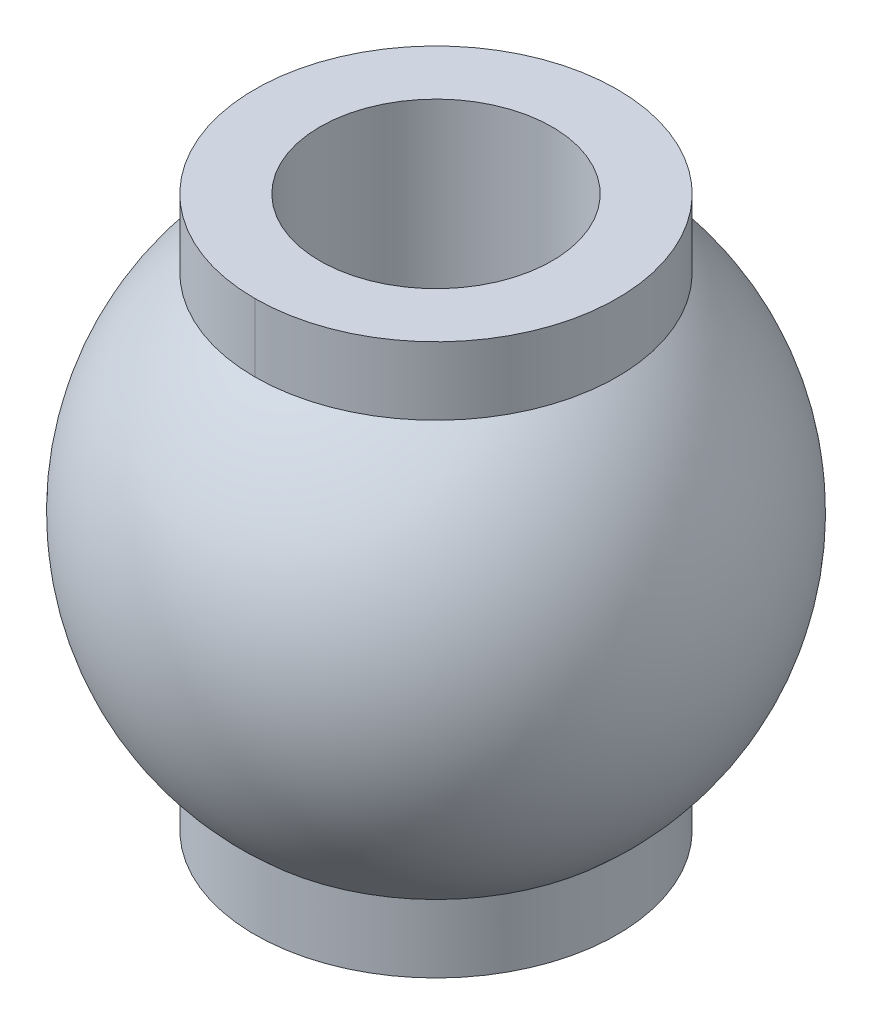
from build123d import *


with BuildPart() as part:
    # Sketch1 → Revolve1 (revolve)
    with BuildSketch(Plane.XY, mode=Mode.PRIVATE) as revolve1_sk:
        with BuildLine():
            Line((3.175, 7.5311), (3.175, -7.5311))
            Line((3.175, -7.5311), (4.953, -7.5311))
            Line((4.953, -7.5311), (4.953, -5.673205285))
            ThreePointArc((4.953, -5.673205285), (7.5311, 0), (4.953, 5.673205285))
            Line((4.953, 5.673205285), (4.953, 7.5311))
            Line((4.953, 7.5311), (3.175, 7.5311))
        make_face()
    revolve(revolve1_sk.sketch.rotate(Axis((0, 21.50669344, 0), (0, -1, 0)), 180), axis=Axis((0, 21.50669344, 0), (0, -1, 0)))


solid = part.part
